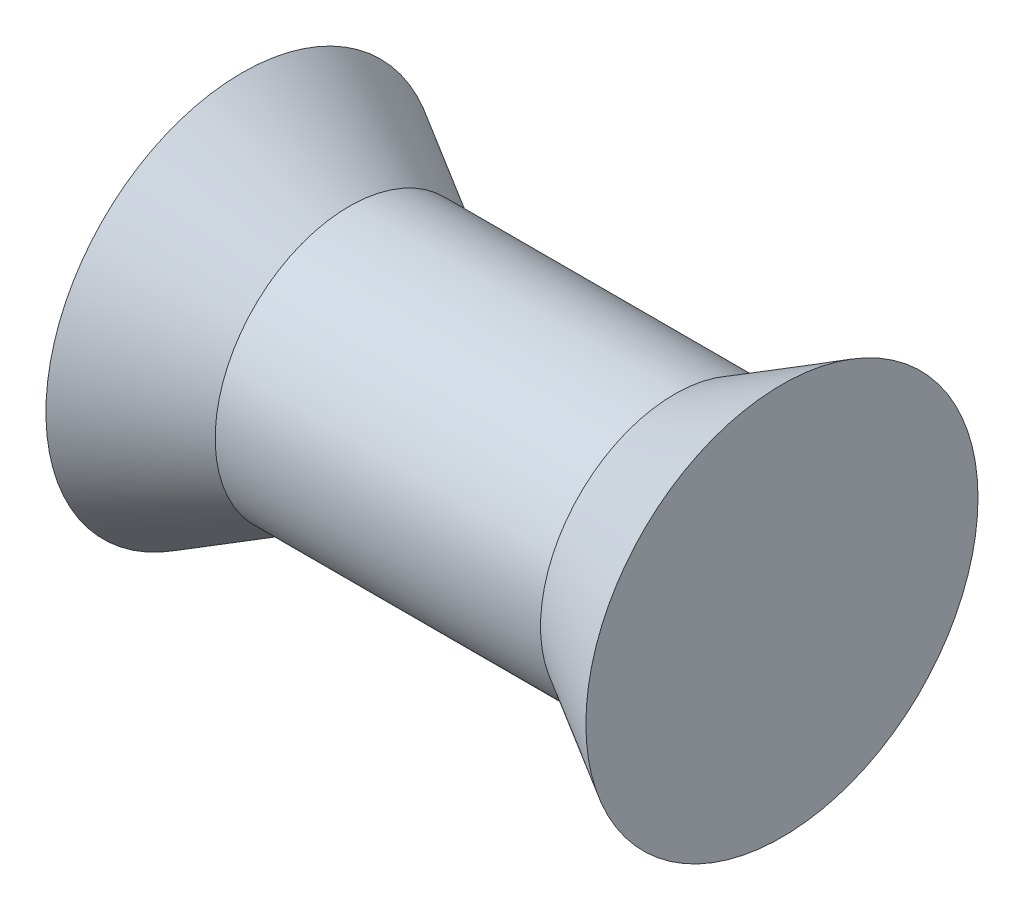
from build123d import *


with BuildPart() as part:
    # Sketch 1 → Revolve 1 (revolve)
    with BuildSketch(Plane.XY, mode=Mode.PRIVATE) as revolve_1_sk:
        with BuildLine():
            Line((0, 0), (0, 2.877711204))
            Line((0, 2.877711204), (-1.5748, 1.9685))
            Line((-1.5748, 1.9685), (-6.35, 1.9685))
            Line((-6.35, 1.9685), (-7.9248, 2.877711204))
            ThreePointArc((-7.9248, 2.877711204), (-8.439518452, 1.479580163), (-8.614298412, 0))
            Line((-8.614298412, 0), (0, 0))
        make_face()
    revolve(revolve_1_sk.sketch.rotate(Axis((0, 0, 0), (-1, 0, 0)), 90), axis=Axis((0, 0, 0), (-1, 0, 0)))


solid = part.part
